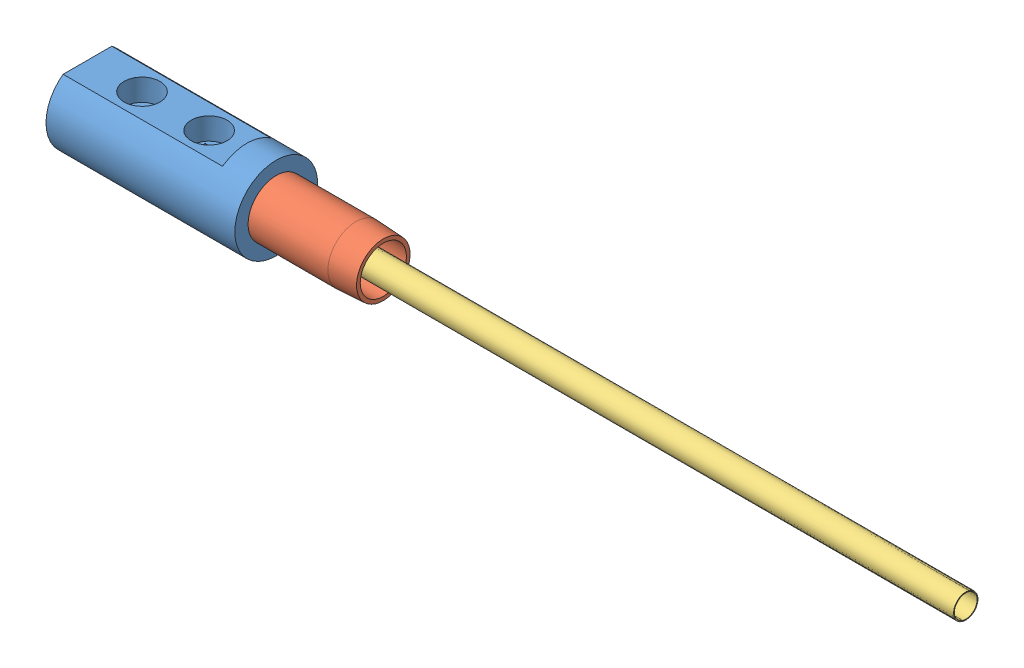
SolidWorks assembly HKC1214.sldasm, configuration Default (file format 11000). Lengths in mm.
Overall size (332.3 31.37 31.37).
3 component instances, 3 part files, 2 mates.
Components (placement in the parent):
- HKCH1214-1: HKCH1214.sldprt [Default] x (1 0 0) z (0 1 0) size (71.72 31.37 31.37)
- GPN50L2-1: GPN50L2.sldprt [Default] at (61.1251 0 0) x (1 0 0) z (0 0.584803 -0.811176) size (50.8 21.34 21.34)
- HFT375L12-1: HFT375L12.sldprt [Default] at (27.4955 0 0) x (0 -0.269367 -0.963038) z (0 -0.963038 0.269367) size (11.1 304.8 11.1)
Mates (geometry in assembly coordinates):
- ProfileCenter1: profile center: circle of HKCH1214-1; plane of GPN50L2-1 through (61.1251 -8.2152 -5.9226) normal (-1 0 0)
- ProfileCenter2: profile center: plane of HFT375L12-1 through (27.4955 1.1631 4.1584) normal (-1 0 0); circle of HKCH1214-1
